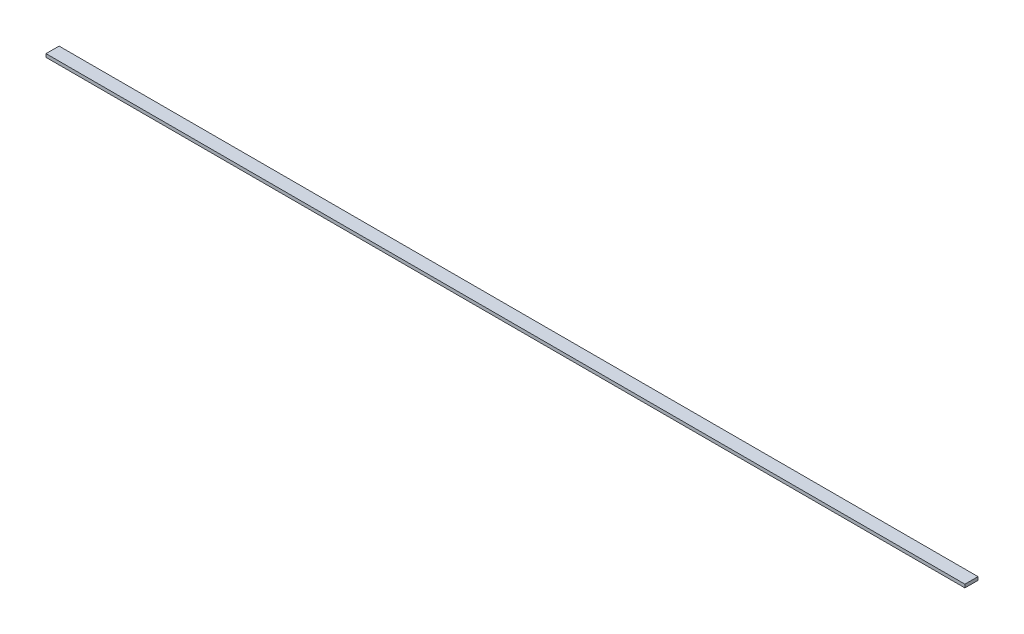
ISO-10303-21;
HEADER;
FILE_DESCRIPTION(('STEP AP214'),'2;1');
FILE_NAME('part.step','',(''),(''),'','','');
FILE_SCHEMA(('AUTOMOTIVE_DESIGN { 1 0 10303 214 1 1 1 1 }'));
ENDSEC;
DATA;
#1=APPLICATION_CONTEXT('core data for automotive mechanical design processes');
#2=APPLICATION_PROTOCOL_DEFINITION('international standard','automotive_design',2000,#1);
#3=PRODUCT_CONTEXT('',#1,'mechanical');
#4=PRODUCT('Part','Part','',(#3));
#5=PRODUCT_RELATED_PRODUCT_CATEGORY('part','',(#4));
#6=PRODUCT_DEFINITION_FORMATION('','',#4);
#7=PRODUCT_DEFINITION_CONTEXT('part definition',#1,'design');
#8=PRODUCT_DEFINITION('design','',#6,#7);
#9=PRODUCT_DEFINITION_SHAPE('','',#8);
#10=(LENGTH_UNIT() NAMED_UNIT(*) SI_UNIT(.MILLI.,.METRE.));
#11=(NAMED_UNIT(*) PLANE_ANGLE_UNIT() SI_UNIT($,.RADIAN.));
#12=(NAMED_UNIT(*) SI_UNIT($,.STERADIAN.) SOLID_ANGLE_UNIT());
#13=UNCERTAINTY_MEASURE_WITH_UNIT(LENGTH_MEASURE(1.E-05),#10,'distance_accuracy_value','');
#14=(GEOMETRIC_REPRESENTATION_CONTEXT(3) GLOBAL_UNCERTAINTY_ASSIGNED_CONTEXT((#13)) GLOBAL_UNIT_ASSIGNED_CONTEXT((#10,
#11,#12)) REPRESENTATION_CONTEXT('',''));
#15=CARTESIAN_POINT('',(0.,0.,0.));
#16=DIRECTION('',(0.,0.,1.));
#17=DIRECTION('',(1.,0.,0.));
#18=AXIS2_PLACEMENT_3D('',#15,#16,#17);
#19=CARTESIAN_POINT('',(892.175,6.35,12.7));
#20=DIRECTION('',(-1.,0.,0.));
#21=DIRECTION('',(0.,0.,1.));
#22=AXIS2_PLACEMENT_3D('',#19,#20,#21);
#23=PLANE('',#22);
#24=DIRECTION('',(0.,0.,-1.));
#25=VECTOR('',#24,1.);
#26=CARTESIAN_POINT('',(892.175,0.,12.7));
#27=LINE('',#26,#25);
#28=CARTESIAN_POINT('',(892.175,0.,12.7));
#29=VERTEX_POINT('',#28);
#30=CARTESIAN_POINT('',(892.175,0.,-12.7));
#31=VERTEX_POINT('',#30);
#32=EDGE_CURVE('E98',#29,#31,#27,.T.);
#33=ORIENTED_EDGE('',*,*,#32,.T.);
#34=DIRECTION('',(0.,-1.,0.));
#35=VECTOR('',#34,1.);
#36=CARTESIAN_POINT('',(892.175,6.35,-12.7));
#37=LINE('',#36,#35);
#38=CARTESIAN_POINT('',(892.175,6.35,-12.7));
#39=VERTEX_POINT('',#38);
#40=EDGE_CURVE('E11',#39,#31,#37,.T.);
#41=ORIENTED_EDGE('',*,*,#40,.F.);
#42=DIRECTION('',(0.,0.,-1.));
#43=VECTOR('',#42,1.);
#44=CARTESIAN_POINT('',(892.175,6.35,12.7));
#45=LINE('',#44,#43);
#46=CARTESIAN_POINT('',(892.175,6.35,12.7));
#47=VERTEX_POINT('',#46);
#48=EDGE_CURVE('E86',#47,#39,#45,.T.);
#49=ORIENTED_EDGE('',*,*,#48,.F.);
#50=DIRECTION('',(0.,-1.,0.));
#51=VECTOR('',#50,1.);
#52=CARTESIAN_POINT('',(892.175,6.35,12.7));
#53=LINE('',#52,#51);
#54=EDGE_CURVE('E94',#47,#29,#53,.T.);
#55=ORIENTED_EDGE('',*,*,#54,.T.);
#56=EDGE_LOOP('',(#33,#41,#49,#55));
#57=FACE_BOUND('',#56,.T.);
#58=ADVANCED_FACE('F35',(#57),#23,.F.);
#59=CARTESIAN_POINT('',(-892.175,6.35,-12.7));
#60=DIRECTION('',(0.,0.,1.));
#61=DIRECTION('',(1.,0.,0.));
#62=AXIS2_PLACEMENT_3D('',#59,#60,#61);
#63=PLANE('',#62);
#64=DIRECTION('',(-1.,0.,0.));
#65=VECTOR('',#64,1.);
#66=CARTESIAN_POINT('',(-892.175,0.,-12.7));
#67=LINE('',#66,#65);
#68=CARTESIAN_POINT('',(-892.175,0.,-12.7));
#69=VERTEX_POINT('',#68);
#70=EDGE_CURVE('E90',#31,#69,#67,.T.);
#71=ORIENTED_EDGE('',*,*,#70,.T.);
#72=DIRECTION('',(0.,-1.,0.));
#73=VECTOR('',#72,1.);
#74=CARTESIAN_POINT('',(-892.175,6.35,-12.7));
#75=LINE('',#74,#73);
#76=CARTESIAN_POINT('',(-892.175,6.35,-12.7));
#77=VERTEX_POINT('',#76);
#78=EDGE_CURVE('E43',#77,#69,#75,.T.);
#79=ORIENTED_EDGE('',*,*,#78,.F.);
#80=DIRECTION('',(-1.,0.,0.));
#81=VECTOR('',#80,1.);
#82=CARTESIAN_POINT('',(-892.175,6.35,-12.7));
#83=LINE('',#82,#81);
#84=EDGE_CURVE('E81',#39,#77,#83,.T.);
#85=ORIENTED_EDGE('',*,*,#84,.F.);
#86=ORIENTED_EDGE('',*,*,#40,.T.);
#87=EDGE_LOOP('',(#71,#79,#85,#86));
#88=FACE_BOUND('',#87,.T.);
#89=ADVANCED_FACE('F89',(#88),#63,.F.);
#90=CARTESIAN_POINT('',(-892.175,6.35,12.7));
#91=DIRECTION('',(1.,0.,0.));
#92=DIRECTION('',(0.,0.,-1.));
#93=AXIS2_PLACEMENT_3D('',#90,#91,#92);
#94=PLANE('',#93);
#95=DIRECTION('',(0.,0.,1.));
#96=VECTOR('',#95,1.);
#97=CARTESIAN_POINT('',(-892.175,0.,12.7));
#98=LINE('',#97,#96);
#99=CARTESIAN_POINT('',(-892.175,0.,12.7));
#100=VERTEX_POINT('',#99);
#101=EDGE_CURVE('E68',#69,#100,#98,.T.);
#102=ORIENTED_EDGE('',*,*,#101,.T.);
#103=DIRECTION('',(0.,-1.,0.));
#104=VECTOR('',#103,1.);
#105=CARTESIAN_POINT('',(-892.175,6.35,12.7));
#106=LINE('',#105,#104);
#107=CARTESIAN_POINT('',(-892.175,6.35,12.7));
#108=VERTEX_POINT('',#107);
#109=EDGE_CURVE('E91',#108,#100,#106,.T.);
#110=ORIENTED_EDGE('',*,*,#109,.F.);
#111=DIRECTION('',(0.,0.,1.));
#112=VECTOR('',#111,1.);
#113=CARTESIAN_POINT('',(-892.175,6.35,12.7));
#114=LINE('',#113,#112);
#115=EDGE_CURVE('E84',#77,#108,#114,.T.);
#116=ORIENTED_EDGE('',*,*,#115,.F.);
#117=ORIENTED_EDGE('',*,*,#78,.T.);
#118=EDGE_LOOP('',(#102,#110,#116,#117));
#119=FACE_BOUND('',#118,.T.);
#120=ADVANCED_FACE('F92',(#119),#94,.F.);
#121=CARTESIAN_POINT('',(-892.175,6.35,12.7));
#122=DIRECTION('',(0.,0.,-1.));
#123=DIRECTION('',(-1.,0.,0.));
#124=AXIS2_PLACEMENT_3D('',#121,#122,#123);
#125=PLANE('',#124);
#126=DIRECTION('',(1.,0.,0.));
#127=VECTOR('',#126,1.);
#128=CARTESIAN_POINT('',(-892.175,0.,12.7));
#129=LINE('',#128,#127);
#130=EDGE_CURVE('E74',#100,#29,#129,.T.);
#131=ORIENTED_EDGE('',*,*,#130,.T.);
#132=ORIENTED_EDGE('',*,*,#54,.F.);
#133=DIRECTION('',(1.,0.,0.));
#134=VECTOR('',#133,1.);
#135=CARTESIAN_POINT('',(-892.175,6.35,12.7));
#136=LINE('',#135,#134);
#137=EDGE_CURVE('E51',#108,#47,#136,.T.);
#138=ORIENTED_EDGE('',*,*,#137,.F.);
#139=ORIENTED_EDGE('',*,*,#109,.T.);
#140=EDGE_LOOP('',(#131,#132,#138,#139));
#141=FACE_BOUND('',#140,.T.);
#142=ADVANCED_FACE('F105',(#141),#125,.F.);
#143=CARTESIAN_POINT('',(0.,6.35,0.));
#144=DIRECTION('',(0.,-1.,0.));
#145=DIRECTION('',(0.,0.,-1.));
#146=AXIS2_PLACEMENT_3D('',#143,#144,#145);
#147=PLANE('',#146);
#148=ORIENTED_EDGE('',*,*,#48,.T.);
#149=ORIENTED_EDGE('',*,*,#84,.T.);
#150=ORIENTED_EDGE('',*,*,#115,.T.);
#151=ORIENTED_EDGE('',*,*,#137,.T.);
#152=EDGE_LOOP('',(#148,#149,#150,#151));
#153=FACE_BOUND('',#152,.T.);
#154=ADVANCED_FACE('F82',(#153),#147,.F.);
#155=CARTESIAN_POINT('',(0.,0.,0.));
#156=DIRECTION('',(0.,-1.,0.));
#157=DIRECTION('',(0.,0.,-1.));
#158=AXIS2_PLACEMENT_3D('',#155,#156,#157);
#159=PLANE('',#158);
#160=ORIENTED_EDGE('',*,*,#32,.F.);
#161=ORIENTED_EDGE('',*,*,#130,.F.);
#162=ORIENTED_EDGE('',*,*,#101,.F.);
#163=ORIENTED_EDGE('',*,*,#70,.F.);
#164=EDGE_LOOP('',(#160,#161,#162,#163));
#165=FACE_BOUND('',#164,.T.);
#166=ADVANCED_FACE('F108',(#165),#159,.T.);
#167=CLOSED_SHELL('',(#58,#89,#120,#142,#154,#166));
#168=MANIFOLD_SOLID_BREP('B2',#167);
#169=ADVANCED_BREP_SHAPE_REPRESENTATION('',(#18,#168),#14);
#170=SHAPE_DEFINITION_REPRESENTATION(#9,#169);
ENDSEC;
END-ISO-10303-21;
